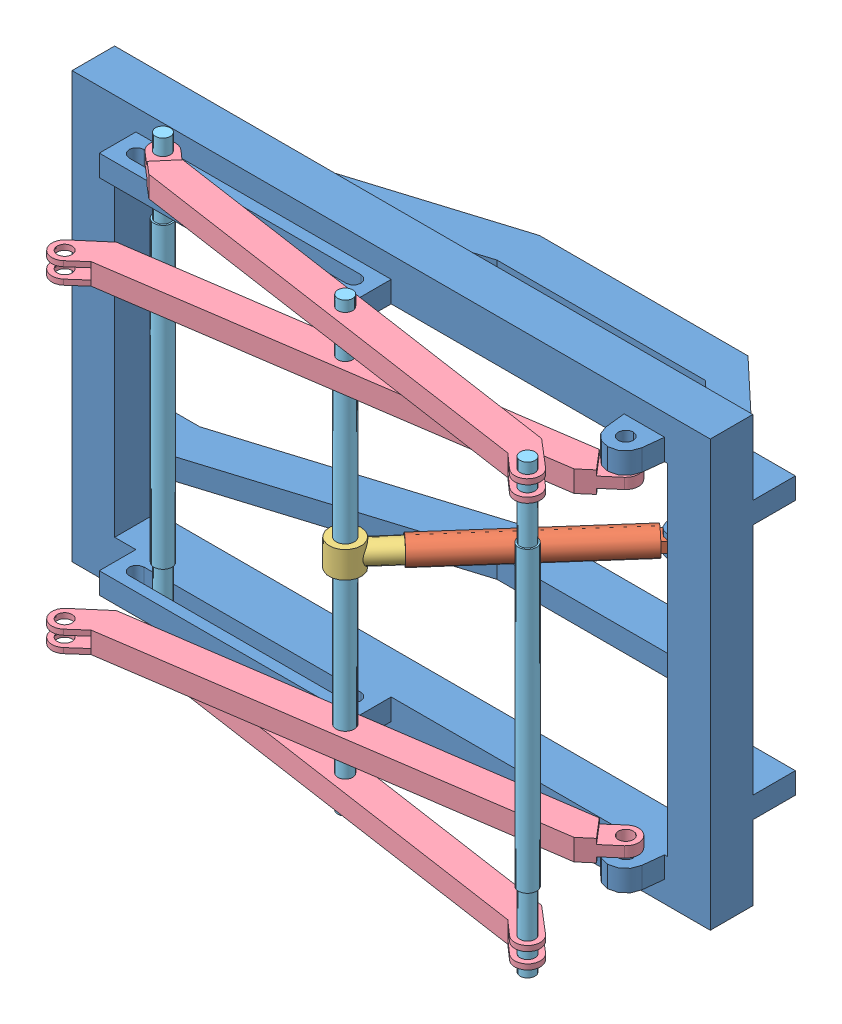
SolidWorks assembly Scissor_Lift.SLDASM, configuration Default (file format 11000). Lengths in mm.
Overall size (3000 2100 1742.46).
17 component instances, 6 part files, 8 mates.
Components (placement in the parent):
- Base-1: Base.SLDPRT [Default] at origin size (3000 2000 949.25)
- platform-1: platform.SLDPRT [Default] at (0 0 1759.9364) x (1 0 0) z (0 0 -1) (suppressed, hidden)
- cylinder-1: cylinder.SLDPRT [Default] at (795.3045 0 -367.7657) x (-0.661592 0 0.749864) z (0 1 0) size (950 120 120)
- Piston-1: Piston.SLDPRT [Default] at (102.046 0 417.9894) x (-0.661592 0 0.749864) z (0 -1 0) size (775 150 125)
- layer_1-1: layer_1.SLDASM [Default] at (-138.5852 0 -136.0114) x (0.987779 0 -0.15586) z (0.15586 0 0.987779) size (2311.11 2100 945.79)
  - crossarm-1: crossarm.SLDPRT [Default] at (151.3438 950 584.7352) x (0 -1 0) z (-0.954527 0 -0.298125) size (100 260 2340)
  - crossarm-2: crossarm.SLDPRT [Default] at (151.3438 -950 584.7352) x (0 -1 0) z (-0.954527 0 -0.298125) size (100 260 2340)
  - cross_rod-1: cross_rod.SLDPRT [Default] at (-887.3124 0 187) x (0.999014 0 -0.044391) z (0 -1 0) size (85 85 2100)
  - cross_rod-2: cross_rod.SLDPRT [Default] at (1190 0 982.4705) x (1 0 0) z (0 -1 0) size (85 85 2100)
- layer_2-1: layer_2.SLDASM [Default] at (43.6887 0 -183.1884) x (0.987779 0 0.15586) z (-0.15586 0 0.987779) size (2311.11 2100 945.79)
  - crossarm-1: crossarm.SLDPRT [Default] at (151.3438 750 584.7352) x (0 1 0) z (0.954527 0 -0.298125) size (100 260 2340)
  - crossarm-2: crossarm.SLDPRT [Default] at (151.3438 -750 584.7352) x (0 1 0) z (0.954527 0 -0.298125) size (100 260 2340)
  - cross_rod-1: cross_rod.SLDPRT [Default] at (151.3438 0 584.7352) x (-0.66325 0 -0.748398) z (0 1 0) size (85 85 2100)
- layer_3-1: layer_3.SLDASM [Default] at (-262.5674 0 -459.7817) x (0.987779 0 -0.15586) z (0.15586 0 0.987779) (suppressed, hidden)
- layer_4-1: layer_4.SLDASM [Default] at (167.6709 0 -506.9587) x (0.987779 0 0.15586) z (-0.15586 0 0.987779) (suppressed, hidden)
- layer_5-1: layer_5.SLDASM [Default] at (-386.5496 0 -783.5521) x (0.987779 0 -0.15586) z (0.15586 0 0.987779) (suppressed, hidden)
- layer_6-1: layer_6.SLDASM [Default] at (291.6531 0 -830.7291) x (0.987779 0 0.15586) z (-0.15586 0 0.987779) (suppressed, hidden)
Mates (geometry in assembly coordinates):
- Tangent3: tangent: plane of Base-1 through (-1110 -900 152) normal (0 0 1); cylinder of layer_1-1/cross_rod-1 through (-985.908 -1050 187) axis (0 1 0) radius 35
- Coincident8: coincident: line of Base-1; line of layer_1-1/crossarm-2 through (-897.4812 -900 341.5338) axis (0.989328 0 0.145709)
- Coincident9: coincident: line of assembly; axis of Base-1 through (1190 -900 187) axis (0 1 0); point of layer_2-1
- Concentric14: concentric: cylinder of layer_1-1/crossarm-2 through (102.046 -789.7918 417.9894) axis (0 -1 0) radius 42.5; cylinder of layer_2-1/cross_rod-1 through (102.046 1050 417.9894) axis (0 -1 0) radius 35
- Concentric17: concentric: cylinder of Piston-1 through (102.046 62.5 417.9894) axis (0 -1 0) radius 42.5; cylinder of layer_2-1/cross_rod-1 through (102.046 700 417.9894) axis (0 -1 0) radius 42.5
- Concentric16: concentric: cylinder of assembly; cylinder of assembly; cylinder of cylinder-1 through (795.3045 0 -367.7657) axis (0.661592 0 -0.749864) radius 50; cylinder of Piston-1 through (102.046 0 417.9894) axis (-0.661592 0 0.749864) radius 50
- Hinge1: hinge: cylinder of assembly; cylinder of assembly; plane of assembly; plane of assembly; cylinder of cylinder-1 through (835 25 -412.7575) axis (0 -1 0) radius 20; cylinder of Base-1 through (835 50 -412.7575) axis (0 -1 0) radius 22.5; plane of Base-1 through (835 -25 -412.7575) normal (0 1 0); plane of cylinder-1 through (835 -25 -412.7575) normal (0 -1 0)
- Distance1: distance = 25 mm: plane of assembly; point of layer_2-1; plane of Base-1 through (1300 -800 100) normal (0 1 0)
